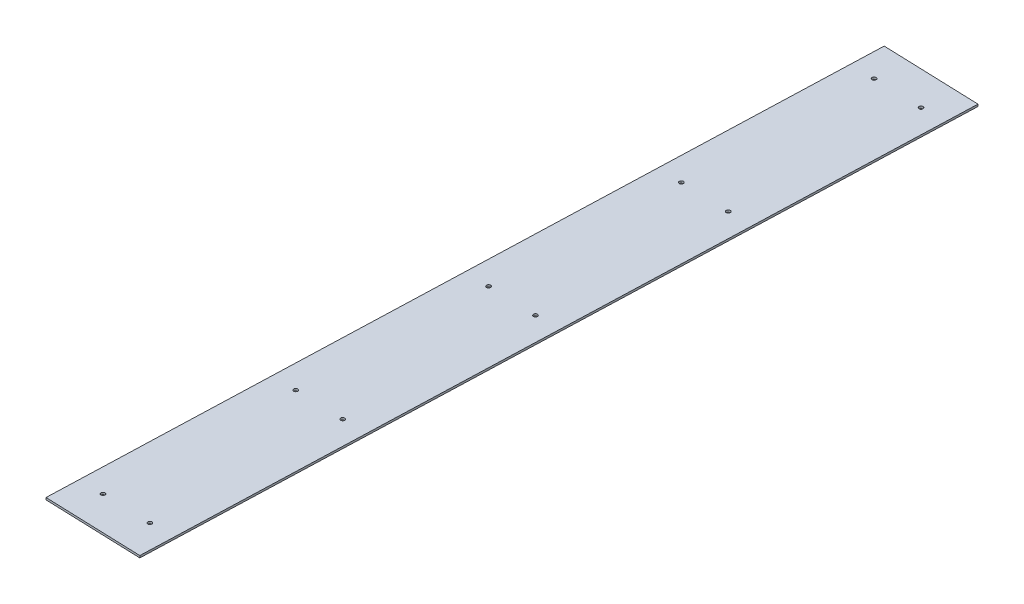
from build123d import *

# Parameters (mm, degrees)
BOSS_EXTRUDE1_DEPTH = 1.6256
SKETCH2_R           = 1.5875
CUT_EXTRUDE1_DEPTH  = 1.6256


with BuildPart() as part:
    # Sketch1 → Boss-Extrude1 (new body)
    with BuildSketch(Plane.XZ.offset(1.6256)):
        Polygon((746.093679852, -545.370131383), (768.152910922, -1179.98685849), (844.306918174, -1177.339750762), (822.247687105, -542.723023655), align=None)
    extrude(amount=BOSS_EXTRUDE1_DEPTH)

    # Sketch2 → Cut-Extrude1 (cut)
    with BuildSketch(Plane.XZ.offset(3.2512)):
        with Locations((766.014550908, -570.093023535)):
            Circle(SKETCH2_R)
        with Locations((771.088174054, -716.05487077)):
            Circle(SKETCH2_R)
        with Locations((776.1617972, -862.016718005)):
            Circle(SKETCH2_R)
        with Locations((781.235420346, -1007.978565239)):
            Circle(SKETCH2_R)
        with Locations((786.309043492, -1153.940412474)):
            Circle(SKETCH2_R)
        with Locations(Location((824.386047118, -1152.61685861, 0), (0, 0, 180))):
            Circle(SKETCH2_R)
        with Locations(Location((819.312423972, -1006.655011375, 0), (0, 0, 180))):
            Circle(SKETCH2_R)
        with Locations(Location((814.238800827, -860.69316414, 0), (0, 0, 180))):
            Circle(SKETCH2_R)
        with Locations(Location((809.165177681, -714.731316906, 0), (0, 0, 180))):
            Circle(SKETCH2_R)
        with Locations(Location((804.091554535, -568.769469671, 0), (0, 0, 180))):
            Circle(SKETCH2_R)
    extrude(amount=-CUT_EXTRUDE1_DEPTH, mode=Mode.SUBTRACT)


solid = part.part
